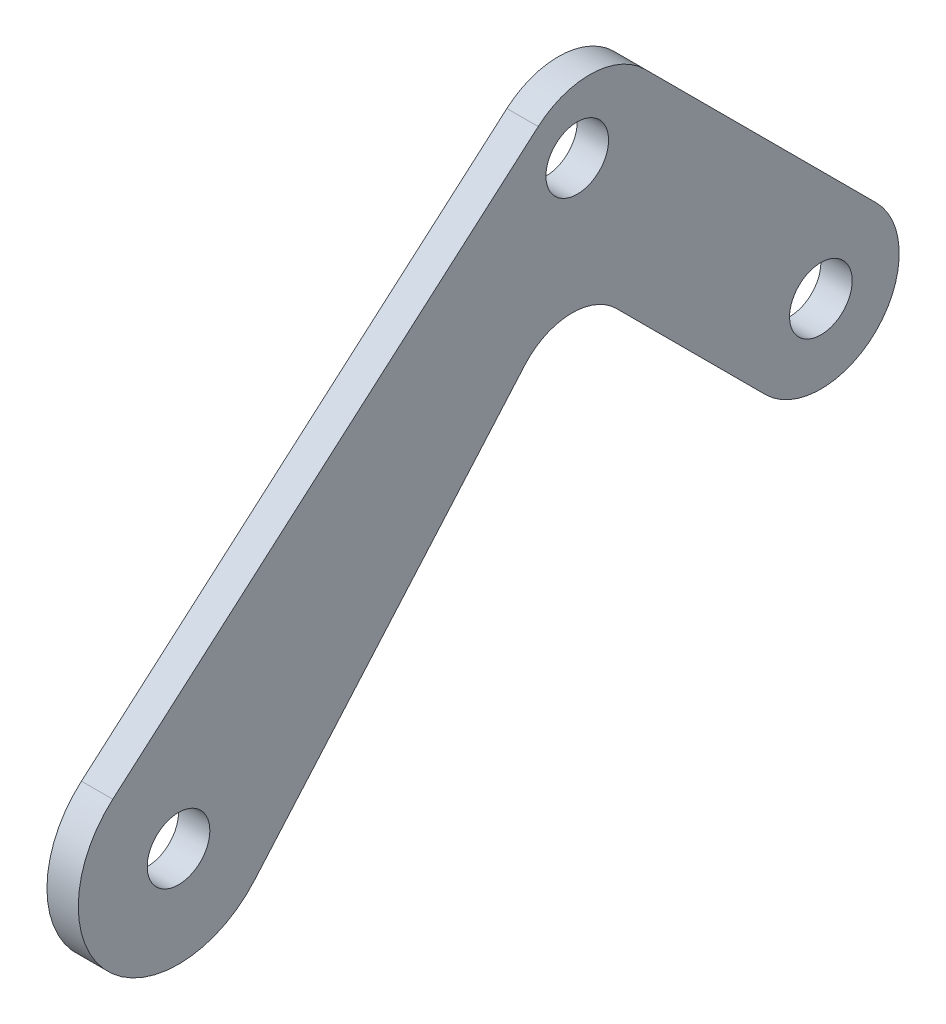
ISO-10303-21;
HEADER;
FILE_DESCRIPTION(('STEP AP214'),'2;1');
FILE_NAME('part.step','',(''),(''),'','','');
FILE_SCHEMA(('AUTOMOTIVE_DESIGN { 1 0 10303 214 1 1 1 1 }'));
ENDSEC;
DATA;
#1=APPLICATION_CONTEXT('core data for automotive mechanical design processes');
#2=APPLICATION_PROTOCOL_DEFINITION('international standard','automotive_design',2000,#1);
#3=PRODUCT_CONTEXT('',#1,'mechanical');
#4=PRODUCT('Part','Part','',(#3));
#5=PRODUCT_RELATED_PRODUCT_CATEGORY('part','',(#4));
#6=PRODUCT_DEFINITION_FORMATION('','',#4);
#7=PRODUCT_DEFINITION_CONTEXT('part definition',#1,'design');
#8=PRODUCT_DEFINITION('design','',#6,#7);
#9=PRODUCT_DEFINITION_SHAPE('','',#8);
#10=(LENGTH_UNIT() NAMED_UNIT(*) SI_UNIT(.MILLI.,.METRE.));
#11=(NAMED_UNIT(*) PLANE_ANGLE_UNIT() SI_UNIT($,.RADIAN.));
#12=(NAMED_UNIT(*) SI_UNIT($,.STERADIAN.) SOLID_ANGLE_UNIT());
#13=UNCERTAINTY_MEASURE_WITH_UNIT(LENGTH_MEASURE(1.E-05),#10,'distance_accuracy_value','');
#14=(GEOMETRIC_REPRESENTATION_CONTEXT(3) GLOBAL_UNCERTAINTY_ASSIGNED_CONTEXT((#13)) GLOBAL_UNIT_ASSIGNED_CONTEXT((#10,
#11,#12)) REPRESENTATION_CONTEXT('',''));
#15=CARTESIAN_POINT('',(0.,0.,0.));
#16=DIRECTION('',(0.,0.,1.));
#17=DIRECTION('',(1.,0.,0.));
#18=AXIS2_PLACEMENT_3D('',#15,#16,#17);
#19=CARTESIAN_POINT('',(1.5875,39.1607118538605,-41.6615932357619));
#20=DIRECTION('',(-1.,0.,0.));
#21=DIRECTION('',(0.,0.,1.));
#22=AXIS2_PLACEMENT_3D('',#19,#20,#21);
#23=CYLINDRICAL_SURFACE('',#22,7.9375);
#24=CARTESIAN_POINT('',(-1.5875,39.1607118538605,-41.6615932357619));
#25=DIRECTION('',(1.,0.,0.));
#26=DIRECTION('',(0.,0.,1.));
#27=AXIS2_PLACEMENT_3D('',#24,#25,#26);
#28=CIRCLE('',#27,7.9375);
#29=CARTESIAN_POINT('',(-1.5875,44.7733719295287,-47.2742533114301));
#30=VERTEX_POINT('',#29);
#31=CARTESIAN_POINT('',(-1.5875,45.1512191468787,-36.4541246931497));
#32=VERTEX_POINT('',#31);
#33=EDGE_CURVE('E101',#30,#32,#28,.T.);
#34=ORIENTED_EDGE('',*,*,#33,.T.);
#35=DIRECTION('',(-1.,0.,0.));
#36=VECTOR('',#35,1.);
#37=CARTESIAN_POINT('',(1.5875,45.1512191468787,-36.4541246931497));
#38=LINE('',#37,#36);
#39=CARTESIAN_POINT('',(1.5875,45.1512191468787,-36.4541246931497));
#40=VERTEX_POINT('',#39);
#41=EDGE_CURVE('E11',#40,#32,#38,.T.);
#42=ORIENTED_EDGE('',*,*,#41,.F.);
#43=CARTESIAN_POINT('',(1.5875,39.1607118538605,-41.6615932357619));
#44=DIRECTION('',(1.,0.,0.));
#45=DIRECTION('',(0.,0.,1.));
#46=AXIS2_PLACEMENT_3D('',#43,#44,#45);
#47=CIRCLE('',#46,7.9375);
#48=CARTESIAN_POINT('',(1.5875,44.7733719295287,-47.2742533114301));
#49=VERTEX_POINT('',#48);
#50=EDGE_CURVE('E133',#49,#40,#47,.T.);
#51=ORIENTED_EDGE('',*,*,#50,.F.);
#52=DIRECTION('',(-1.,0.,0.));
#53=VECTOR('',#52,1.);
#54=CARTESIAN_POINT('',(1.5875,44.7733719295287,-47.2742533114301));
#55=LINE('',#54,#53);
#56=EDGE_CURVE('E114',#49,#30,#55,.T.);
#57=ORIENTED_EDGE('',*,*,#56,.T.);
#58=EDGE_LOOP('',(#34,#42,#51,#57));
#59=FACE_BOUND('',#58,.T.);
#60=ADVANCED_FACE('F33',(#59),#23,.T.);
#61=CARTESIAN_POINT('',(1.5875,7.66784933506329,6.66555973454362));
#62=DIRECTION('',(0.,-0.754709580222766,-0.656059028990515));
#63=DIRECTION('',(0.,0.656059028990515,-0.754709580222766));
#64=AXIS2_PLACEMENT_3D('',#61,#62,#63);
#65=PLANE('',#64);
#66=DIRECTION('',(0.,-0.656059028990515,0.754709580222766));
#67=VECTOR('',#66,1.);
#68=CARTESIAN_POINT('',(-1.5875,7.66784933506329,6.66555973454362));
#69=LINE('',#68,#67);
#70=CARTESIAN_POINT('',(-1.5875,7.66784933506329,6.66555973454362));
#71=VERTEX_POINT('',#70);
#72=EDGE_CURVE('E97',#32,#71,#69,.T.);
#73=ORIENTED_EDGE('',*,*,#72,.T.);
#74=DIRECTION('',(-1.,0.,0.));
#75=VECTOR('',#74,1.);
#76=CARTESIAN_POINT('',(1.5875,7.66784933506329,6.66555973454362));
#77=LINE('',#76,#75);
#78=CARTESIAN_POINT('',(1.5875,7.66784933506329,6.66555973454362));
#79=VERTEX_POINT('',#78);
#80=EDGE_CURVE('E40',#79,#71,#77,.T.);
#81=ORIENTED_EDGE('',*,*,#80,.F.);
#82=DIRECTION('',(0.,-0.656059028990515,0.754709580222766));
#83=VECTOR('',#82,1.);
#84=CARTESIAN_POINT('',(1.5875,7.66784933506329,6.66555973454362));
#85=LINE('',#84,#83);
#86=EDGE_CURVE('E110',#40,#79,#85,.T.);
#87=ORIENTED_EDGE('',*,*,#86,.F.);
#88=ORIENTED_EDGE('',*,*,#41,.T.);
#89=EDGE_LOOP('',(#73,#81,#87,#88));
#90=FACE_BOUND('',#89,.T.);
#91=ADVANCED_FACE('F109',(#90),#65,.F.);
#92=CARTESIAN_POINT('',(1.5875,0.,0.));
#93=DIRECTION('',(-1.,0.,0.));
#94=DIRECTION('',(0.,0.,1.));
#95=AXIS2_PLACEMENT_3D('',#92,#93,#94);
#96=CYLINDRICAL_SURFACE('',#95,10.16);
#97=CARTESIAN_POINT('',(-1.5875,0.,0.));
#98=DIRECTION('',(1.,0.,0.));
#99=DIRECTION('',(0.,0.,1.));
#100=AXIS2_PLACEMENT_3D('',#97,#98,#99);
#101=CIRCLE('',#100,10.16);
#102=CARTESIAN_POINT('',(-1.5875,-6.66555973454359,-7.66784933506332));
#103=VERTEX_POINT('',#102);
#104=EDGE_CURVE('E103',#71,#103,#101,.T.);
#105=ORIENTED_EDGE('',*,*,#104,.T.);
#106=DIRECTION('',(-1.,0.,0.));
#107=VECTOR('',#106,1.);
#108=CARTESIAN_POINT('',(1.5875,-6.66555973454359,-7.66784933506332));
#109=LINE('',#108,#107);
#110=CARTESIAN_POINT('',(1.5875,-6.66555973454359,-7.66784933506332));
#111=VERTEX_POINT('',#110);
#112=EDGE_CURVE('E159',#111,#103,#109,.T.);
#113=ORIENTED_EDGE('',*,*,#112,.F.);
#114=CARTESIAN_POINT('',(1.5875,0.,0.));
#115=DIRECTION('',(1.,0.,0.));
#116=DIRECTION('',(0.,0.,1.));
#117=AXIS2_PLACEMENT_3D('',#114,#115,#116);
#118=CIRCLE('',#117,10.16);
#119=EDGE_CURVE('E136',#79,#111,#118,.T.);
#120=ORIENTED_EDGE('',*,*,#119,.F.);
#121=ORIENTED_EDGE('',*,*,#80,.T.);
#122=EDGE_LOOP('',(#105,#113,#120,#121));
#123=FACE_BOUND('',#122,.T.);
#124=ADVANCED_FACE('F163',(#123),#96,.T.);
#125=CARTESIAN_POINT('',(1.5875,24.8908660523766,-35.0994317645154));
#126=DIRECTION('',(0.,0.656059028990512,0.754709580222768));
#127=DIRECTION('',(0.,-0.754709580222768,0.656059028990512));
#128=AXIS2_PLACEMENT_3D('',#125,#126,#127);
#129=PLANE('',#128);
#130=DIRECTION('',(0.,0.754709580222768,-0.656059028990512));
#131=VECTOR('',#130,1.);
#132=CARTESIAN_POINT('',(-1.5875,24.8908660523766,-35.0994317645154));
#133=LINE('',#132,#131);
#134=CARTESIAN_POINT('',(-1.5875,24.8908660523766,-35.0994317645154));
#135=VERTEX_POINT('',#134);
#136=EDGE_CURVE('E123',#103,#135,#133,.T.);
#137=ORIENTED_EDGE('',*,*,#136,.T.);
#138=DIRECTION('',(-1.,0.,0.));
#139=VECTOR('',#138,1.);
#140=CARTESIAN_POINT('',(1.5875,24.8908660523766,-35.0994317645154));
#141=LINE('',#140,#139);
#142=CARTESIAN_POINT('',(1.5875,24.8908660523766,-35.0994317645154));
#143=VERTEX_POINT('',#142);
#144=EDGE_CURVE('E156',#143,#135,#141,.T.);
#145=ORIENTED_EDGE('',*,*,#144,.F.);
#146=DIRECTION('',(0.,0.754709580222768,-0.656059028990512));
#147=VECTOR('',#146,1.);
#148=CARTESIAN_POINT('',(1.5875,24.8908660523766,-35.0994317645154));
#149=LINE('',#148,#147);
#150=EDGE_CURVE('E138',#111,#143,#149,.T.);
#151=ORIENTED_EDGE('',*,*,#150,.F.);
#152=ORIENTED_EDGE('',*,*,#112,.T.);
#153=EDGE_LOOP('',(#137,#145,#151,#152));
#154=FACE_BOUND('',#153,.T.);
#155=ADVANCED_FACE('F171',(#154),#129,.F.);
#156=CARTESIAN_POINT('',(1.5875,20.7248912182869,-39.89183759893));
#157=DIRECTION('',(-1.,0.,0.));
#158=DIRECTION('',(0.,0.,1.));
#159=AXIS2_PLACEMENT_3D('',#156,#157,#158);
#160=CYLINDRICAL_SURFACE('',#159,6.35);
#161=CARTESIAN_POINT('',(-1.5875,20.7248912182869,-39.89183759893));
#162=DIRECTION('',(-1.,0.,0.));
#163=DIRECTION('',(0.,0.,-1.));
#164=AXIS2_PLACEMENT_3D('',#161,#162,#163);
#165=CIRCLE('',#164,6.35);
#166=CARTESIAN_POINT('',(-1.5875,25.2150192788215,-44.3819656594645));
#167=VERTEX_POINT('',#166);
#168=EDGE_CURVE('E125',#135,#167,#165,.T.);
#169=ORIENTED_EDGE('',*,*,#168,.T.);
#170=DIRECTION('',(-1.,0.,0.));
#171=VECTOR('',#170,1.);
#172=CARTESIAN_POINT('',(1.5875,25.2150192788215,-44.3819656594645));
#173=LINE('',#172,#171);
#174=CARTESIAN_POINT('',(1.5875,25.2150192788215,-44.3819656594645));
#175=VERTEX_POINT('',#174);
#176=EDGE_CURVE('E153',#175,#167,#173,.T.);
#177=ORIENTED_EDGE('',*,*,#176,.F.);
#178=CARTESIAN_POINT('',(1.5875,20.7248912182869,-39.89183759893));
#179=DIRECTION('',(-1.,0.,0.));
#180=DIRECTION('',(0.,0.,-1.));
#181=AXIS2_PLACEMENT_3D('',#178,#179,#180);
#182=CIRCLE('',#181,6.35);
#183=EDGE_CURVE('E140',#143,#175,#182,.T.);
#184=ORIENTED_EDGE('',*,*,#183,.F.);
#185=ORIENTED_EDGE('',*,*,#144,.T.);
#186=EDGE_LOOP('',(#169,#177,#184,#185));
#187=FACE_BOUND('',#186,.T.);
#188=ADVANCED_FACE('F174',(#187),#160,.F.);
#189=CARTESIAN_POINT('',(1.5875,10.1027881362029,-59.4941968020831));
#190=DIRECTION('',(0.,0.707106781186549,-0.707106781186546));
#191=DIRECTION('',(0.,0.707106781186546,0.707106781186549));
#192=AXIS2_PLACEMENT_3D('',#189,#190,#191);
#193=PLANE('',#192);
#194=DIRECTION('',(0.,-0.707106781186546,-0.707106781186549));
#195=VECTOR('',#194,1.);
#196=CARTESIAN_POINT('',(-1.5875,10.1027881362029,-59.4941968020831));
#197=LINE('',#196,#195);
#198=CARTESIAN_POINT('',(-1.5875,10.1027881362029,-59.4941968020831));
#199=VERTEX_POINT('',#198);
#200=EDGE_CURVE('E127',#167,#199,#197,.T.);
#201=ORIENTED_EDGE('',*,*,#200,.T.);
#202=DIRECTION('',(-1.,0.,0.));
#203=VECTOR('',#202,1.);
#204=CARTESIAN_POINT('',(1.5875,10.1027881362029,-59.4941968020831));
#205=LINE('',#204,#203);
#206=CARTESIAN_POINT('',(1.5875,10.1027881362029,-59.4941968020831));
#207=VERTEX_POINT('',#206);
#208=EDGE_CURVE('E150',#207,#199,#205,.T.);
#209=ORIENTED_EDGE('',*,*,#208,.F.);
#210=DIRECTION('',(0.,-0.707106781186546,-0.707106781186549));
#211=VECTOR('',#210,1.);
#212=CARTESIAN_POINT('',(1.5875,10.1027881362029,-59.4941968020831));
#213=LINE('',#212,#211);
#214=EDGE_CURVE('E142',#175,#207,#213,.T.);
#215=ORIENTED_EDGE('',*,*,#214,.F.);
#216=ORIENTED_EDGE('',*,*,#176,.T.);
#217=EDGE_LOOP('',(#201,#209,#215,#216));
#218=FACE_BOUND('',#217,.T.);
#219=ADVANCED_FACE('F179',(#218),#193,.F.);
#220=CARTESIAN_POINT('',(1.5875,15.7154482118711,-65.1068568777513));
#221=DIRECTION('',(-1.,0.,0.));
#222=DIRECTION('',(0.,0.,1.));
#223=AXIS2_PLACEMENT_3D('',#220,#221,#222);
#224=CYLINDRICAL_SURFACE('',#223,7.9375);
#225=CARTESIAN_POINT('',(-1.5875,15.7154482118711,-65.1068568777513));
#226=DIRECTION('',(1.,0.,0.));
#227=DIRECTION('',(0.,0.,1.));
#228=AXIS2_PLACEMENT_3D('',#225,#226,#227);
#229=CIRCLE('',#228,7.9375);
#230=CARTESIAN_POINT('',(-1.5875,21.3281082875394,-70.7195169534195));
#231=VERTEX_POINT('',#230);
#232=EDGE_CURVE('E129',#199,#231,#229,.T.);
#233=ORIENTED_EDGE('',*,*,#232,.T.);
#234=DIRECTION('',(-1.,0.,0.));
#235=VECTOR('',#234,1.);
#236=CARTESIAN_POINT('',(1.5875,21.3281082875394,-70.7195169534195));
#237=LINE('',#236,#235);
#238=CARTESIAN_POINT('',(1.5875,21.3281082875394,-70.7195169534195));
#239=VERTEX_POINT('',#238);
#240=EDGE_CURVE('E147',#239,#231,#237,.T.);
#241=ORIENTED_EDGE('',*,*,#240,.F.);
#242=CARTESIAN_POINT('',(1.5875,15.7154482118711,-65.1068568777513));
#243=DIRECTION('',(1.,0.,0.));
#244=DIRECTION('',(0.,0.,1.));
#245=AXIS2_PLACEMENT_3D('',#242,#243,#244);
#246=CIRCLE('',#245,7.9375);
#247=EDGE_CURVE('E52',#207,#239,#246,.T.);
#248=ORIENTED_EDGE('',*,*,#247,.F.);
#249=ORIENTED_EDGE('',*,*,#208,.T.);
#250=EDGE_LOOP('',(#233,#241,#248,#249));
#251=FACE_BOUND('',#250,.T.);
#252=ADVANCED_FACE('F182',(#251),#224,.T.);
#253=CARTESIAN_POINT('',(1.5875,44.7733719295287,-47.2742533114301));
#254=DIRECTION('',(0.,-0.707106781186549,0.707106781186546));
#255=DIRECTION('',(0.,-0.707106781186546,-0.707106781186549));
#256=AXIS2_PLACEMENT_3D('',#253,#254,#255);
#257=PLANE('',#256);
#258=DIRECTION('',(0.,0.707106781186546,0.707106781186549));
#259=VECTOR('',#258,1.);
#260=CARTESIAN_POINT('',(-1.5875,44.7733719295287,-47.2742533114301));
#261=LINE('',#260,#259);
#262=EDGE_CURVE('E131',#231,#30,#261,.T.);
#263=ORIENTED_EDGE('',*,*,#262,.T.);
#264=ORIENTED_EDGE('',*,*,#56,.F.);
#265=DIRECTION('',(0.,0.707106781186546,0.707106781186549));
#266=VECTOR('',#265,1.);
#267=CARTESIAN_POINT('',(1.5875,44.7733719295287,-47.2742533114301));
#268=LINE('',#267,#266);
#269=EDGE_CURVE('E47',#239,#49,#268,.T.);
#270=ORIENTED_EDGE('',*,*,#269,.F.);
#271=ORIENTED_EDGE('',*,*,#240,.T.);
#272=EDGE_LOOP('',(#263,#264,#270,#271));
#273=FACE_BOUND('',#272,.T.);
#274=ADVANCED_FACE('F184',(#273),#257,.F.);
#275=CARTESIAN_POINT('',(1.5875,39.1607118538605,-41.6615932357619));
#276=DIRECTION('',(-1.,0.,0.));
#277=DIRECTION('',(0.,0.,1.));
#278=AXIS2_PLACEMENT_3D('',#275,#276,#277);
#279=PLANE('',#278);
#280=CARTESIAN_POINT('',(1.5875,15.7154482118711,-65.1068568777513));
#281=DIRECTION('',(1.,0.,0.));
#282=DIRECTION('',(0.,0.,-1.));
#283=AXIS2_PLACEMENT_3D('',#280,#281,#282);
#284=CIRCLE('',#283,3.175);
#285=CARTESIAN_POINT('',(1.5875,15.7154482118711,-68.2818568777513));
#286=VERTEX_POINT('',#285);
#287=EDGE_CURVE('E275',#286,#286,#284,.T.);
#288=ORIENTED_EDGE('',*,*,#287,.F.);
#289=EDGE_LOOP('',(#288));
#290=FACE_BOUND('',#289,.T.);
#291=CARTESIAN_POINT('',(1.5875,40.4111525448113,-40.4111525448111));
#292=DIRECTION('',(1.,0.,0.));
#293=DIRECTION('',(0.,0.,-1.));
#294=AXIS2_PLACEMENT_3D('',#291,#292,#293);
#295=CIRCLE('',#294,3.175);
#296=CARTESIAN_POINT('',(1.5875,40.4111525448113,-43.5861525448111));
#297=VERTEX_POINT('',#296);
#298=EDGE_CURVE('E277',#297,#297,#295,.T.);
#299=ORIENTED_EDGE('',*,*,#298,.F.);
#300=EDGE_LOOP('',(#299));
#301=FACE_BOUND('',#300,.T.);
#302=CARTESIAN_POINT('',(1.5875,0.,0.));
#303=DIRECTION('',(1.,0.,0.));
#304=DIRECTION('',(0.,0.,-1.));
#305=AXIS2_PLACEMENT_3D('',#302,#303,#304);
#306=CIRCLE('',#305,3.175);
#307=CARTESIAN_POINT('',(1.5875,0.,-3.175));
#308=VERTEX_POINT('',#307);
#309=EDGE_CURVE('E118',#308,#308,#306,.T.);
#310=ORIENTED_EDGE('',*,*,#309,.F.);
#311=EDGE_LOOP('',(#310));
#312=FACE_BOUND('',#311,.T.);
#313=ORIENTED_EDGE('',*,*,#50,.T.);
#314=ORIENTED_EDGE('',*,*,#86,.T.);
#315=ORIENTED_EDGE('',*,*,#119,.T.);
#316=ORIENTED_EDGE('',*,*,#150,.T.);
#317=ORIENTED_EDGE('',*,*,#183,.T.);
#318=ORIENTED_EDGE('',*,*,#214,.T.);
#319=ORIENTED_EDGE('',*,*,#247,.T.);
#320=ORIENTED_EDGE('',*,*,#269,.T.);
#321=EDGE_LOOP('',(#313,#314,#315,#316,#317,#318,#319,#320));
#322=FACE_BOUND('',#321,.T.);
#323=ADVANCED_FACE('F166',(#290,#301,#312,#322),#279,.F.);
#324=CARTESIAN_POINT('',(-1.5875,39.1607118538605,-41.6615932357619));
#325=DIRECTION('',(-1.,0.,0.));
#326=DIRECTION('',(0.,0.,1.));
#327=AXIS2_PLACEMENT_3D('',#324,#325,#326);
#328=PLANE('',#327);
#329=CARTESIAN_POINT('',(-1.5875,15.7154482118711,-65.1068568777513));
#330=DIRECTION('',(1.,0.,0.));
#331=DIRECTION('',(0.,0.,-1.));
#332=AXIS2_PLACEMENT_3D('',#329,#330,#331);
#333=CIRCLE('',#332,3.175);
#334=CARTESIAN_POINT('',(-1.5875,15.7154482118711,-68.2818568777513));
#335=VERTEX_POINT('',#334);
#336=EDGE_CURVE('E272',#335,#335,#333,.T.);
#337=ORIENTED_EDGE('',*,*,#336,.T.);
#338=EDGE_LOOP('',(#337));
#339=FACE_BOUND('',#338,.T.);
#340=CARTESIAN_POINT('',(-1.5875,40.4111525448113,-40.4111525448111));
#341=DIRECTION('',(1.,0.,0.));
#342=DIRECTION('',(0.,0.,-1.));
#343=AXIS2_PLACEMENT_3D('',#340,#341,#342);
#344=CIRCLE('',#343,3.175);
#345=CARTESIAN_POINT('',(-1.5875,40.4111525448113,-43.5861525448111));
#346=VERTEX_POINT('',#345);
#347=EDGE_CURVE('E282',#346,#346,#344,.T.);
#348=ORIENTED_EDGE('',*,*,#347,.T.);
#349=EDGE_LOOP('',(#348));
#350=FACE_BOUND('',#349,.T.);
#351=CARTESIAN_POINT('',(-1.5875,0.,0.));
#352=DIRECTION('',(1.,0.,0.));
#353=DIRECTION('',(0.,0.,-1.));
#354=AXIS2_PLACEMENT_3D('',#351,#352,#353);
#355=CIRCLE('',#354,3.175);
#356=CARTESIAN_POINT('',(-1.5875,0.,-3.175));
#357=VERTEX_POINT('',#356);
#358=EDGE_CURVE('E115',#357,#357,#355,.T.);
#359=ORIENTED_EDGE('',*,*,#358,.T.);
#360=EDGE_LOOP('',(#359));
#361=FACE_BOUND('',#360,.T.);
#362=ORIENTED_EDGE('',*,*,#33,.F.);
#363=ORIENTED_EDGE('',*,*,#262,.F.);
#364=ORIENTED_EDGE('',*,*,#232,.F.);
#365=ORIENTED_EDGE('',*,*,#200,.F.);
#366=ORIENTED_EDGE('',*,*,#168,.F.);
#367=ORIENTED_EDGE('',*,*,#136,.F.);
#368=ORIENTED_EDGE('',*,*,#104,.F.);
#369=ORIENTED_EDGE('',*,*,#72,.F.);
#370=EDGE_LOOP('',(#362,#363,#364,#365,#366,#367,#368,#369));
#371=FACE_BOUND('',#370,.T.);
#372=ADVANCED_FACE('F98',(#339,#350,#361,#371),#328,.T.);
#373=CARTESIAN_POINT('',(-1.5875,0.,0.));
#374=DIRECTION('',(1.,0.,0.));
#375=DIRECTION('',(0.,0.,-1.));
#376=AXIS2_PLACEMENT_3D('',#373,#374,#375);
#377=CYLINDRICAL_SURFACE('',#376,3.175);
#378=ORIENTED_EDGE('',*,*,#358,.F.);
#379=EDGE_LOOP('',(#378));
#380=FACE_BOUND('',#379,.T.);
#381=ORIENTED_EDGE('',*,*,#309,.T.);
#382=EDGE_LOOP('',(#381));
#383=FACE_BOUND('',#382,.T.);
#384=ADVANCED_FACE('F226',(#380,#383),#377,.F.);
#385=CARTESIAN_POINT('',(-1.5875,40.4111525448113,-40.4111525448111));
#386=DIRECTION('',(1.,0.,0.));
#387=DIRECTION('',(0.,0.,-1.));
#388=AXIS2_PLACEMENT_3D('',#385,#386,#387);
#389=CYLINDRICAL_SURFACE('',#388,3.175);
#390=ORIENTED_EDGE('',*,*,#347,.F.);
#391=EDGE_LOOP('',(#390));
#392=FACE_BOUND('',#391,.T.);
#393=ORIENTED_EDGE('',*,*,#298,.T.);
#394=EDGE_LOOP('',(#393));
#395=FACE_BOUND('',#394,.T.);
#396=ADVANCED_FACE('F231',(#392,#395),#389,.F.);
#397=CARTESIAN_POINT('',(-1.5875,15.7154482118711,-65.1068568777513));
#398=DIRECTION('',(1.,0.,0.));
#399=DIRECTION('',(0.,0.,-1.));
#400=AXIS2_PLACEMENT_3D('',#397,#398,#399);
#401=CYLINDRICAL_SURFACE('',#400,3.175);
#402=ORIENTED_EDGE('',*,*,#336,.F.);
#403=EDGE_LOOP('',(#402));
#404=FACE_BOUND('',#403,.T.);
#405=ORIENTED_EDGE('',*,*,#287,.T.);
#406=EDGE_LOOP('',(#405));
#407=FACE_BOUND('',#406,.T.);
#408=ADVANCED_FACE('F255',(#404,#407),#401,.F.);
#409=CLOSED_SHELL('',(#60,#91,#124,#155,#188,#219,#252,#274,#323,#372,#384,#396,#408));
#410=MANIFOLD_SOLID_BREP('B2',#409);
#411=ADVANCED_BREP_SHAPE_REPRESENTATION('',(#18,#410),#14);
#412=SHAPE_DEFINITION_REPRESENTATION(#9,#411);
ENDSEC;
END-ISO-10303-21;
